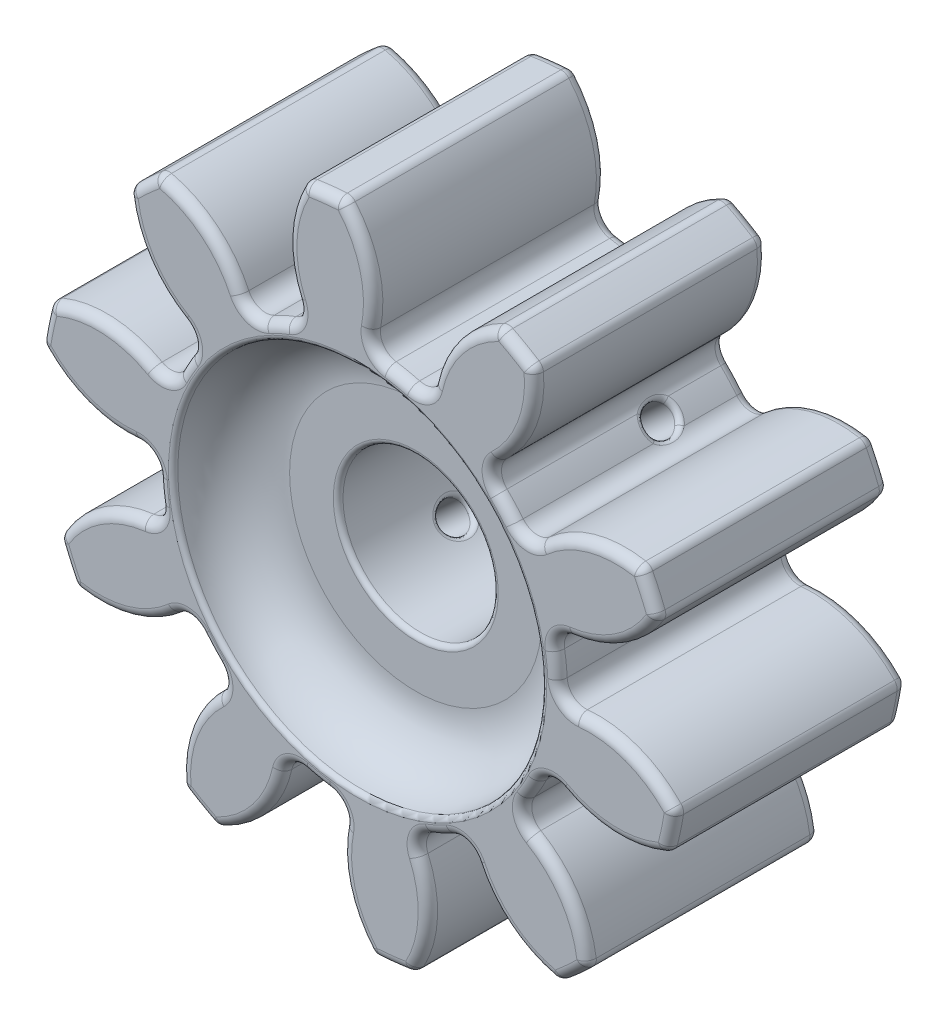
from build123d import *

# Parameters (mm, degrees)
EXTRUDE_1_DEPTH          = 6
PATTERN_CIRCULAR_1_COUNT = 10
SKETCH_2_R               = 10.3125
SKETCH_2_R_2             = 4
EXTRUDE_2_DEPTH          = 6
EXTRUDE_3_DEPTH          = 6
PATTERN_CIRCULAR_2_COUNT = 10
FILLET_1_R               = 0.5
SKETCH_4_R               = 0.75
CUT_EXTRUDE_1_DEPTH      = 11
FILLET_2_R               = 0.25
FILLET_3_R               = 0.25


with BuildPart() as part:
    # Sketch 1 → Extrude 1 (new, symmetric)
    with BuildSketch(Plane.XY):
        with BuildLine():
            ThreePointArc((-0.781322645, 16.481490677), (-1.795863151, 16.401977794), (-2.803572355, 16.260073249))
            ThreePointArc((-2.803572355, 16.260073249), (-3.622314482, 13.090323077), (-2.613735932, 9.975772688))
            ThreePointArc((-2.613735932, 9.975772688), (-1.12241447, 10.251236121), (0.393180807, 10.305001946))
            ThreePointArc((0.393180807, 10.305001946), (0.7039149, 13.564004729), (-0.781322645, 16.481490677))
        make_face()
    extrude(amount=EXTRUDE_1_DEPTH, both=True)


with BuildPart() as pattern_circular_1_1:
    # Pattern Circular 1: pattern copy
    add(part.part.rotate(Axis((0, 0, 0), (0, 0, 1)), 1 * 360 / PATTERN_CIRCULAR_1_COUNT))


with BuildPart() as pattern_circular_1_2:
    # Pattern Circular 1: pattern copy
    add(part.part.rotate(Axis((0, 0, 0), (0, 0, 1)), 2 * 360 / PATTERN_CIRCULAR_1_COUNT))


with BuildPart() as pattern_circular_1_3:
    # Pattern Circular 1: pattern copy
    add(part.part.rotate(Axis((0, 0, 0), (0, 0, 1)), 3 * 360 / PATTERN_CIRCULAR_1_COUNT))


with BuildPart() as pattern_circular_1_4:
    # Pattern Circular 1: pattern copy
    add(part.part.rotate(Axis((0, 0, 0), (0, 0, 1)), 4 * 360 / PATTERN_CIRCULAR_1_COUNT))


with BuildPart() as pattern_circular_1_5:
    # Pattern Circular 1: pattern copy
    add(part.part.rotate(Axis((0, 0, 0), (0, 0, 1)), 5 * 360 / PATTERN_CIRCULAR_1_COUNT))


with BuildPart() as pattern_circular_1_6:
    # Pattern Circular 1: pattern copy
    add(part.part.rotate(Axis((0, 0, 0), (0, 0, 1)), 6 * 360 / PATTERN_CIRCULAR_1_COUNT))


with BuildPart() as pattern_circular_1_7:
    # Pattern Circular 1: pattern copy
    add(part.part.rotate(Axis((0, 0, 0), (0, 0, 1)), 7 * 360 / PATTERN_CIRCULAR_1_COUNT))


with BuildPart() as pattern_circular_1_8:
    # Pattern Circular 1: pattern copy
    add(part.part.rotate(Axis((0, 0, 0), (0, 0, 1)), 8 * 360 / PATTERN_CIRCULAR_1_COUNT))


with BuildPart() as pattern_circular_1_9:
    # Pattern Circular 1: pattern copy
    add(part.part.rotate(Axis((0, 0, 0), (0, 0, 1)), 9 * 360 / PATTERN_CIRCULAR_1_COUNT))


with BuildPart() as part_1:
    add(part.part)

    add(pattern_circular_1_1.part)  # Extrude 2 merges Pattern Circular 1_1

    add(pattern_circular_1_2.part)  # Extrude 2 merges Pattern Circular 1_2

    add(pattern_circular_1_3.part)  # Extrude 2 merges Pattern Circular 1_3

    add(pattern_circular_1_4.part)  # Extrude 2 merges Pattern Circular 1_4

    add(pattern_circular_1_5.part)  # Extrude 2 merges Pattern Circular 1_5

    add(pattern_circular_1_6.part)  # Extrude 2 merges Pattern Circular 1_6

    add(pattern_circular_1_7.part)  # Extrude 2 merges Pattern Circular 1_7

    add(pattern_circular_1_8.part)  # Extrude 2 merges Pattern Circular 1_8

    add(pattern_circular_1_9.part)  # Extrude 2 merges Pattern Circular 1_9
    # Sketch 2 → Extrude 2 (add, symmetric)
    with BuildSketch(Plane.XY):
        Circle(SKETCH_2_R)
        Circle(SKETCH_2_R_2, mode=Mode.SUBTRACT)
    extrude(amount=EXTRUDE_2_DEPTH, both=True)

    # Sketch 3 → Extrude 3 (add, symmetric)
    with BuildSketch(Plane.XY):
        with BuildLine():
            ThreePointArc((0.393180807, 10.305001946), (0.567897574, 10.811214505), (0.695693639, 11.33125803))
            ThreePointArc((0.695693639, 11.33125803), (0.852197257, 10.596764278), (1.492259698, 10.20396086))
            ThreePointArc((1.492259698, 10.20396086), (0.944072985, 10.269195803), (0.393180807, 10.305001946))
        make_face()
        with BuildLine():
            ThreePointArc((3.749055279, 9.606885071), (3.229586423, 9.793744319), (2.700862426, 9.952537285))
            ThreePointArc((2.700862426, 9.952537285), (3.444473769, 10.057497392), (3.880908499, 10.668643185))
            ThreePointArc((3.880908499, 10.668643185), (3.790709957, 10.14077831), (3.749055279, 9.606885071))
        make_face()
    extrude_3 = extrude(amount=EXTRUDE_3_DEPTH, both=True)

    # Pattern Circular 2: Extrude 3 ×10 about axis
    pattern_circular_2_axis = Axis((0, 0, 0), (0, 0, 1))
    for i in range(1, PATTERN_CIRCULAR_2_COUNT):
        add(extrude_3.rotate(pattern_circular_2_axis, i * 360 / PATTERN_CIRCULAR_2_COUNT))

    # Fillet 1
    fillet_1_edges = [part_1.edges().sort_by_distance(p)[0] for p in [
        (-3.614019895, 13.625774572, 6),
        (-11.093724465, 12.213896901, -6),
        (-10.319680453, 12.874556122, 0),
        (-10.932832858, 8.899215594, -6),
        (-11.825568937, 11.506777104, 0),
        (-11.093724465, 12.213896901, 6),
        (-10.932832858, 8.899215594, 6),
        (0.579951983, 14.084975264, -6),
        (0.579951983, 14.084975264, 6),
        (0.852197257, 10.596764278, -6),
        (0.852197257, 10.596764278, 6),
        (2.100326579, 10.096350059, -6),
        (2.100326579, 10.096350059, 6),
        (3.444473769, 10.057497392, -6),
        (3.444473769, 10.057497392, 6),
        (-4, 0, -6),
        (8.748131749, 11.054097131, -6),
        (8.748131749, 11.054097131, 6),
        (6.918063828, 8.072053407, -6),
        (6.918063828, 8.072053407, 6),
        (-4, 0, 6),
        (7.633685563, 6.93357779, -6),
        (7.633685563, 6.93357779, 6),
        (8.698286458, 6.112075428, -6),
        (8.698286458, 6.112075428, 6),
        (13.574822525, 3.80092961, -6),
        (13.574822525, 3.80092961, 6),
        (10.341465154, 2.464092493, -6),
        (10.341465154, 2.464092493, 6),
        (10.251236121, 1.12241447, -6),
        (10.251236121, 1.12241447, 6),
        (10.629649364, -0.167951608, -6),
        (10.629649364, -0.167951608, 6),
        (13.216392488, -4.904063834, -6),
        (13.216392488, -4.904063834, 6),
        (9.814778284, -4.085068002, -6),
        (9.814778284, -4.085068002, 6),
        (8.953162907, -5.117473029, -6),
        (8.953162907, -5.117473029, 6),
        (8.500847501, -6.383826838, -6),
        (8.500847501, -6.383826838, 6),
        (7.809749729, -11.735871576, -6),
        (7.809749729, -11.735871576, 6),
        (5.539179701, -9.073871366, -6),
        (5.539179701, -9.073871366, 6),
        (4.23528577, -9.402659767, -6),
        (4.23528577, -9.402659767, 6),
        (3.125010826, -10.161297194, -6),
        (3.125010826, -10.161297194, 6),
        (-0.579951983, -14.084975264, -6),
        (-0.579951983, -14.084975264, 6),
        (-0.852197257, -10.596764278, -6),
        (-0.852197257, -10.596764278, 6),
        (-2.100326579, -10.096350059, -6),
        (-2.100326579, -10.096350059, 6),
        (-3.444473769, -10.057497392, -6),
        (-3.444473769, -10.057497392, 6),
        (8.187956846, 14.325060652, -6),
        (9.055473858, 13.793055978, 0),
        (5.085225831, 13.147750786, -6),
        (7.289293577, 14.802574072, 0),
        (-8.748131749, -11.054097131, -6),
        (-8.748131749, -11.054097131, 6),
        (8.187956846, 14.325060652, 6),
        (-6.918063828, -8.072053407, -6),
        (5.085225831, 13.147750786, 6),
        (-6.918063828, -8.072053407, 6),
        (-7.633685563, -6.93357779, -6),
        (-7.633685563, -6.93357779, 6),
        (-8.698286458, -6.112075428, -6),
        (-8.698286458, -6.112075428, 6),
        (-13.574822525, -3.80092961, -6),
        (-13.574822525, -3.80092961, 6),
        (-10.341465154, -2.464092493, -6),
        (-10.341465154, -2.464092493, 6),
        (-10.251236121, -1.12241447, -6),
        (-10.251236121, -1.12241447, 6),
        (-10.629649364, 0.167951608, -6),
        (-10.629649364, 0.167951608, 6),
        (-13.216392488, 4.904063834, -6),
        (-13.216392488, 4.904063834, 6),
        (-9.814778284, 4.085068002, -6),
        (-9.814778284, 4.085068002, 6),
        (-8.953162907, 5.117473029, -6),
        (-8.953162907, 5.117473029, 6),
        (-8.500847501, 6.383826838, -6),
        (-8.500847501, 6.383826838, 6),
        (-7.809749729, 11.735871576, -6),
        (-7.809749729, 11.735871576, 6),
        (-5.539179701, 9.073871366, -6),
        (-5.539179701, 9.073871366, 6),
        (-4.23528577, 9.402659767, -6),
        (-4.23528577, 9.402659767, 6),
        (-3.125010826, 10.161297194, -6),
        (-3.125010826, 10.161297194, 6),
        (15.044255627, 6.776457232, -6),
        (15.433387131, 5.836142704, 0),
        (11.842088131, 7.647733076, -6),
        (14.597897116, 7.690994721, 0),
        (15.044255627, 6.776457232, 6),
        (11.842088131, 7.647733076, 6),
        (16.154160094, -3.360522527, -6),
        (15.916271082, -4.349978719, 0),
        (14.075675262, -0.773458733, -6),
        (16.330600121, -2.358283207, 0),
        (16.154160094, -3.360522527, 6),
        (14.075675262, -0.773458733, 6),
        (-3.614019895, 13.625774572, -6),
        (-1.795863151, 16.401977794, -6),
        (11.093724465, -12.213896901, -6),
        (10.319680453, -12.874556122, 0),
        (10.932832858, -8.899215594, -6),
        (11.825568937, -11.506777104, 0),
        (11.093724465, -12.213896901, 6),
        (10.932832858, -8.899215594, 6),
        (1.795863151, -16.401977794, -6),
        (0.781322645, -16.481490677, 0),
        (3.614019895, -13.625774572, -6),
        (2.803572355, -16.260073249, 0),
        (1.795863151, -16.401977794, 6),
        (3.614019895, -13.625774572, 6),
        (-1.795863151, 16.401977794, 6),
        (-2.803572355, 16.260073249, 0),
        (-0.781322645, 16.481490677, 0),
        (-8.187956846, -14.325060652, -6),
        (-9.055473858, -13.793055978, 0),
        (-5.085225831, -13.147750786, -6),
        (-7.289293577, -14.802574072, 0),
        (-8.187956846, -14.325060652, 6),
        (-5.085225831, -13.147750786, 6),
        (-15.044255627, -6.776457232, -6),
        (-15.433387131, -5.836142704, 0),
        (-11.842088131, -7.647733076, -6),
        (-14.597897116, -7.690994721, 0),
        (-15.044255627, -6.776457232, 6),
        (-11.842088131, -7.647733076, 6),
        (-16.154160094, 3.360522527, -6),
        (-15.916271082, 4.349978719, 0),
        (-14.075675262, 0.773458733, -6),
        (-16.330600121, 2.358283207, 0),
        (-16.154160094, 3.360522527, 6),
        (-14.075675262, 0.773458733, 6),
    ]]
    fillet(fillet_1_edges, radius=FILLET_1_R)

    # Sketch 4 → Cut-Extrude 1 (cut, symmetric)
    with BuildSketch(Plane(origin=(0, 0, 0), x_dir=(0.6723469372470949, -0.7402361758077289, 0), z_dir=(-0.7402361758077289, -0.6723469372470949, 0))):
        with Locations((0, -2)):
            Circle(SKETCH_4_R)
    extrude(amount=CUT_EXTRUDE_1_DEPTH, both=True, mode=Mode.SUBTRACT)

    # Fillet 2
    fillet_2_edges = [part_1.edges().sort_by_distance(p)[0] for p in [
        (-8.12522909, -6.366850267, -2),
        (-3.412691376, -2.086513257, -2),
        (2.40417097, 3.196867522, -1.999999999),
        (7.633685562, 6.93357779, -1.249999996),
        (7.116708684, 7.47720453, -2),
        (7.633685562, 6.93357779, -2.750000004),
        (8.10084134, 6.390577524, -1.77686806),
        (-7.633685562, -6.93357779, -1.249999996),
        (-7.137987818, -7.450653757, -2.22313194),
        (-7.633685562, -6.93357779, -2.750000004),
    ]]
    fillet(fillet_2_edges, radius=FILLET_2_R)

    # Sketch 5 → Cut-Revolve 1 (revolve, cut)
    with BuildSketch(Plane(origin=(0, 0, 0), x_dir=(0, 0, -1), z_dir=(1, 0, 0)), mode=Mode.PRIVATE) as cut_revolve_1_sk:
        with BuildLine():
            Line((-6, 0), (-3, 0))
            Line((-3, 0), (-3, 6.5))
            ThreePointArc((-3, 6.5), (-3.878679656, 8.621320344), (-6, 9.5))
            Line((-6, 9.5), (-6, 0))
        make_face()
    revolve(cut_revolve_1_sk.sketch.rotate(Axis((0, 0, 0), (0, 0, 1)), 90), axis=Axis((0, 0, 0), (0, 0, 1)), mode=Mode.SUBTRACT)

    # Fillet 3
    fillet_3_edges = [part_1.edges().sort_by_distance(p)[0] for p in [
        (-4, 0, 3),
        (9.5, 0, 6),
    ]]
    fillet(fillet_3_edges, radius=FILLET_3_R)


solid = part_1.part
